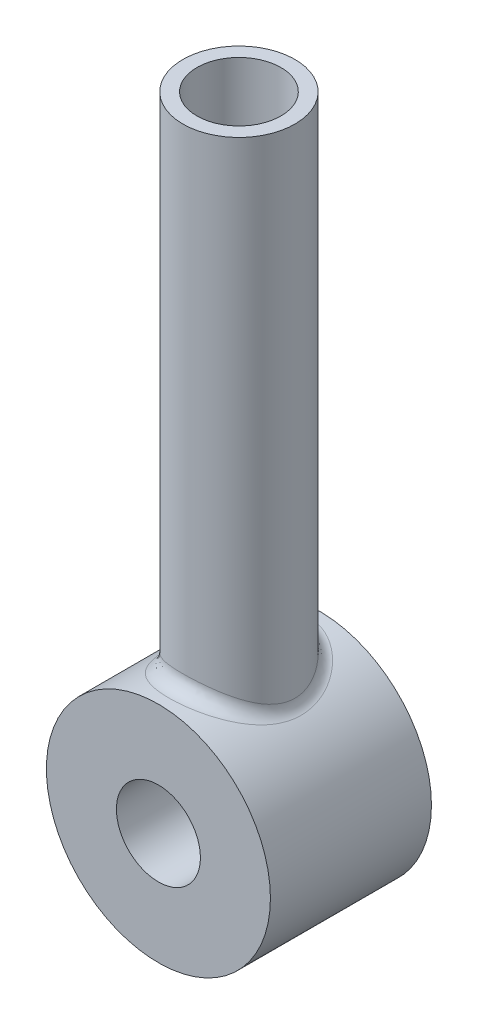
ISO-10303-21;
HEADER;
FILE_DESCRIPTION(('STEP AP214'),'2;1');
FILE_NAME('part.step','',(''),(''),'','','');
FILE_SCHEMA(('AUTOMOTIVE_DESIGN { 1 0 10303 214 1 1 1 1 }'));
ENDSEC;
DATA;
#1=APPLICATION_CONTEXT('core data for automotive mechanical design processes');
#2=APPLICATION_PROTOCOL_DEFINITION('international standard','automotive_design',2000,#1);
#3=PRODUCT_CONTEXT('',#1,'mechanical');
#4=PRODUCT('Part','Part','',(#3));
#5=PRODUCT_RELATED_PRODUCT_CATEGORY('part','',(#4));
#6=PRODUCT_DEFINITION_FORMATION('','',#4);
#7=PRODUCT_DEFINITION_CONTEXT('part definition',#1,'design');
#8=PRODUCT_DEFINITION('design','',#6,#7);
#9=PRODUCT_DEFINITION_SHAPE('','',#8);
#10=(LENGTH_UNIT() NAMED_UNIT(*) SI_UNIT(.MILLI.,.METRE.));
#11=(NAMED_UNIT(*) PLANE_ANGLE_UNIT() SI_UNIT($,.RADIAN.));
#12=(NAMED_UNIT(*) SI_UNIT($,.STERADIAN.) SOLID_ANGLE_UNIT());
#13=UNCERTAINTY_MEASURE_WITH_UNIT(LENGTH_MEASURE(1.E-05),#10,'distance_accuracy_value','');
#14=(GEOMETRIC_REPRESENTATION_CONTEXT(3) GLOBAL_UNCERTAINTY_ASSIGNED_CONTEXT((#13)) GLOBAL_UNIT_ASSIGNED_CONTEXT((#10,
#11,#12)) REPRESENTATION_CONTEXT('',''));
#15=CARTESIAN_POINT('',(0.,0.,0.));
#16=DIRECTION('',(0.,0.,1.));
#17=DIRECTION('',(1.,0.,0.));
#18=AXIS2_PLACEMENT_3D('',#15,#16,#17);
#19=CARTESIAN_POINT('',(1.12764573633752E-05,-7.38049995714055,15.8125404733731));
#20=DIRECTION('',(0.,0.,-1.));
#21=DIRECTION('',(-1.,0.,0.));
#22=AXIS2_PLACEMENT_3D('',#19,#20,#21);
#23=CYLINDRICAL_SURFACE('',#22,14.);
#24=CARTESIAN_POINT('',(-3.06461596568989,6.27995610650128,-2.29208771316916));
#25=CARTESIAN_POINT('',(-2.46024483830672,6.41554251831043,-0.811377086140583));
#26=CARTESIAN_POINT('',(-2.75815324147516,7.98751311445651,-0.683662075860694));
#27=CARTESIAN_POINT('',(-2.85996545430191,6.32586893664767,-2.39079084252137));
#28=CARTESIAN_POINT('',(-2.28454614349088,6.44540163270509,-0.876553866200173));
#29=CARTESIAN_POINT('',(-2.57396778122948,8.03916504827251,-0.762624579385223));
#30=CARTESIAN_POINT('',(-2.65081958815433,6.36794960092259,-2.47994843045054));
#31=CARTESIAN_POINT('',(-2.10892367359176,6.47177377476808,-0.933612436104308));
#32=CARTESIAN_POINT('',(-2.38573650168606,8.08650579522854,-0.833950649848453));
#33=CARTESIAN_POINT('',(-2.22511609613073,6.44322905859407,-2.63802722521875));
#34=CARTESIAN_POINT('',(-1.75666255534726,6.51800594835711,-1.03323233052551));
#35=CARTESIAN_POINT('',(-2.00260335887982,8.1711951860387,-0.960413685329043));
#36=CARTESIAN_POINT('',(-2.00856240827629,6.47643249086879,-2.70695900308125));
#37=CARTESIAN_POINT('',(-1.58035630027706,6.53776531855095,-1.0755727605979));
#38=CARTESIAN_POINT('',(-1.80770503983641,8.2085490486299,-1.01555910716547));
#39=CARTESIAN_POINT('',(-1.56986497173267,6.53296003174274,-2.82361732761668));
#40=CARTESIAN_POINT('',(-1.22745481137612,6.57088437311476,-1.14640009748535));
#41=CARTESIAN_POINT('',(-1.41287734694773,8.27214253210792,-1.10888576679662));
#42=CARTESIAN_POINT('',(-1.34772494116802,6.55629053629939,-2.87135760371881));
#43=CARTESIAN_POINT('',(-1.051269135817,6.58416455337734,-1.17471590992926));
#44=CARTESIAN_POINT('',(-1.21295131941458,8.29838934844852,-1.14707798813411));
#45=CARTESIAN_POINT('',(-0.899756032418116,6.59236250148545,-2.94494050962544));
#46=CARTESIAN_POINT('',(-0.698736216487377,6.60453078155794,-1.21810975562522));
#47=CARTESIAN_POINT('',(-0.809779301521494,8.33897030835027,-1.20594431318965));
#48=CARTESIAN_POINT('',(-0.673927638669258,6.60510534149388,-2.97078599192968));
#49=CARTESIAN_POINT('',(-0.522854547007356,6.61156228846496,-1.23307140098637));
#50=CARTESIAN_POINT('',(-0.606533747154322,8.35330600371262,-1.22662069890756));
#51=CARTESIAN_POINT('',(-0.248278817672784,6.61871636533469,-2.9983783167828));
#52=CARTESIAN_POINT('',(-0.192188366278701,6.61907760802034,-1.24906130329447));
#53=CARTESIAN_POINT('',(-0.223449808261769,8.36861840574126,-1.24869455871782));
#54=CARTESIAN_POINT('',(-0.0486246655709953,6.62083692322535,-3.0026669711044));
#55=CARTESIAN_POINT('',(-0.0377582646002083,6.62023590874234,-1.25152488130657));
#56=CARTESIAN_POINT('',(-0.0437610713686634,8.3710040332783,-1.25212548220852));
#57=CARTESIAN_POINT('',(0.350363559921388,6.61653753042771,-2.99395996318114));
#58=CARTESIAN_POINT('',(0.271547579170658,6.61787051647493,-1.24649309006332));
#59=CARTESIAN_POINT('',(0.31532833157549,8.36616721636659,-1.24515987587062));
#60=CARTESIAN_POINT('',(0.549697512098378,6.61011487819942,-2.98095883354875));
#61=CARTESIAN_POINT('',(0.426083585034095,6.61435052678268,-1.23900559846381));
#62=CARTESIAN_POINT('',(0.494728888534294,8.35894173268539,-1.23475897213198));
#63=CARTESIAN_POINT('',(0.946344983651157,6.58889100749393,-2.93784179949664));
#64=CARTESIAN_POINT('',(0.735611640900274,6.60253840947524,-1.21386245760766));
#65=CARTESIAN_POINT('',(0.8517116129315,8.3350648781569,-1.20026534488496));
#66=CARTESIAN_POINT('',(1.14365941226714,6.57409374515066,-2.90773397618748));
#67=CARTESIAN_POINT('',(0.89027401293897,6.59427394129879,-1.19626571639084));
#68=CARTESIAN_POINT('',(1.02929459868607,8.31841795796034,-1.17617908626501));
#69=CARTESIAN_POINT('',(1.53498585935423,6.53648649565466,-2.83077886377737));
#70=CARTESIAN_POINT('',(1.20014122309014,6.57281895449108,-1.15051141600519));
#71=CARTESIAN_POINT('',(1.38148840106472,8.27610980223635,-1.11461499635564));
#72=CARTESIAN_POINT('',(1.72899658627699,6.51367344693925,-2.78392517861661));
#73=CARTESIAN_POINT('',(1.35504116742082,6.55967072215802,-1.12244427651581));
#74=CARTESIAN_POINT('',(1.55609805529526,8.25044512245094,-1.07713204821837));
#75=CARTESIAN_POINT('',(2.10583117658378,6.46148196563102,-2.67589117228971));
#76=CARTESIAN_POINT('',(1.65981122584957,6.52881805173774,-1.05638838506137));
#77=CARTESIAN_POINT('',(1.89524918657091,8.19172970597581,-0.990704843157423));
#78=CARTESIAN_POINT('',(2.28881150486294,6.43235152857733,-2.61524866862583));
#79=CARTESIAN_POINT('',(1.80939528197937,6.51134103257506,-1.01889307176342));
#80=CARTESIAN_POINT('',(2.05993148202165,8.15895796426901,-0.942190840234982));
#81=CARTESIAN_POINT('',(2.64934938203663,6.3677586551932,-2.47947283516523));
#82=CARTESIAN_POINT('',(2.10816188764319,6.47157795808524,-0.93316492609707));
#83=CARTESIAN_POINT('',(2.38441557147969,8.08629098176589,-0.833570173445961));
#84=CARTESIAN_POINT('',(2.8269050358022,6.33229403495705,-2.40433450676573));
#85=CARTESIAN_POINT('',(2.25714481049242,6.4493541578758,-0.885069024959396));
#86=CARTESIAN_POINT('',(2.54421565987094,8.04639328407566,-0.773459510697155));
#87=CARTESIAN_POINT('',(3.34990097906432,6.2174881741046,-2.15820952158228));
#88=CARTESIAN_POINT('',(2.70041975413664,6.37579960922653,-0.724802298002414));
#89=CARTESIAN_POINT('',(3.01491200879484,7.91723669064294,-0.576559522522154));
#90=CARTESIAN_POINT('',(3.6859568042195,6.12969355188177,-1.96642961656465));
#91=CARTESIAN_POINT('',(2.99428236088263,6.3173315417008,-0.596135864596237));
#92=CARTESIAN_POINT('',(3.31736225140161,7.81846774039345,-0.42313559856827));
#93=CARTESIAN_POINT('',(4.35429850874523,5.93011064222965,-1.5146313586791));
#94=CARTESIAN_POINT('',(3.59416240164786,6.17725849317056,-0.279323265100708));
#95=CARTESIAN_POINT('',(3.91886978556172,7.59393696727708,-0.061696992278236));
#96=CARTESIAN_POINT('',(4.68375071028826,5.81690478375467,-1.2501492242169));
#97=CARTESIAN_POINT('',(3.89912891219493,6.09457258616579,-0.0882651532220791));
#98=CARTESIAN_POINT('',(4.21537676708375,7.46658037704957,0.149888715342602));
#99=CARTESIAN_POINT('',(5.300815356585,5.58139366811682,-0.669100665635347));
#100=CARTESIAN_POINT('',(4.48307001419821,5.91482470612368,0.347982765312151));
#101=CARTESIAN_POINT('',(4.77073494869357,7.20163037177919,0.614727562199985));
#102=CARTESIAN_POINT('',(5.5883869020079,5.45907969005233,-0.352483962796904));
#103=CARTESIAN_POINT('',(4.76253183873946,5.81809552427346,0.591949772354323));
#104=CARTESIAN_POINT('',(5.02954933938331,7.06402714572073,0.868020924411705));
#105=CARTESIAN_POINT('',(6.14745708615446,5.20179282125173,0.366101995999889));
#106=CARTESIAN_POINT('',(5.31325242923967,5.60861556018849,1.16052616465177));
#107=CARTESIAN_POINT('',(5.53271250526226,6.77457941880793,1.44288969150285));
#108=CARTESIAN_POINT('',(6.41333348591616,5.0669762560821,0.773695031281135));
#109=CARTESIAN_POINT('',(5.58222657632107,5.49494347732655,1.49111133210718));
#110=CARTESIAN_POINT('',(5.77200126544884,6.62291078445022,1.76896411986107));
#111=CARTESIAN_POINT('',(6.88087195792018,4.81476517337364,1.63961592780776));
#112=CARTESIAN_POINT('',(6.05900709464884,5.27812750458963,2.20770714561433));
#113=CARTESIAN_POINT('',(6.1927858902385,6.33917331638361,2.46170083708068));
#114=CARTESIAN_POINT('',(7.08258357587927,4.69735725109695,2.09790427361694));
#115=CARTESIAN_POINT('',(6.26902069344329,5.17433709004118,2.59399038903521));
#116=CARTESIAN_POINT('',(6.3743263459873,6.20708940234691,2.82833151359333));
#117=CARTESIAN_POINT('',(7.31624823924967,4.55595706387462,2.77315295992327));
#118=CARTESIAN_POINT('',(6.51371881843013,5.04784051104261,3.17160998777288));
#119=CARTESIAN_POINT('',(6.58462454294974,6.04801419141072,3.36853046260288));
#120=CARTESIAN_POINT('',(7.37829268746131,4.5176202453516,2.97362526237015));
#121=CARTESIAN_POINT('',(6.57872135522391,5.01344387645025,3.34323977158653));
#122=CARTESIAN_POINT('',(6.64046454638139,6.00488527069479,3.52890830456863));
#123=CARTESIAN_POINT('',(7.48954786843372,4.44790482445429,3.38048180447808));
#124=CARTESIAN_POINT('',(6.69544415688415,4.95070399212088,3.69269538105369));
#125=CARTESIAN_POINT('',(6.74059420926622,5.92645542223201,3.85439353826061));
#126=CARTESIAN_POINT('',(7.5387650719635,4.4165227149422,3.5868630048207));
#127=CARTESIAN_POINT('',(6.74730031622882,4.92229368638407,3.87067459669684));
#128=CARTESIAN_POINT('',(6.78488969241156,5.89115054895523,4.0194984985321));
#129=CARTESIAN_POINT('',(7.62378150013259,4.36176082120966,4.00423970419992));
#130=CARTESIAN_POINT('',(6.8369253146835,4.87262917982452,4.23143038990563));
#131=CARTESIAN_POINT('',(6.8614044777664,5.82954341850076,4.35339985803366));
#132=CARTESIAN_POINT('',(7.65959138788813,4.33837467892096,4.21523139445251));
#133=CARTESIAN_POINT('',(6.87481190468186,4.85131275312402,4.41439487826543));
#134=CARTESIAN_POINT('',(6.89363337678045,5.80323400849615,4.52219321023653));
#135=CARTESIAN_POINT('',(7.71738617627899,4.30039580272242,4.64060574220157));
#136=CARTESIAN_POINT('',(6.93594617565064,4.81667787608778,4.78372296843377));
#137=CARTESIAN_POINT('',(6.94564868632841,5.76050777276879,4.86249268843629));
#138=CARTESIAN_POINT('',(7.73937099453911,4.2858031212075,4.85498841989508));
#139=CARTESIAN_POINT('',(6.95927043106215,4.80331682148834,4.97030738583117));
#140=CARTESIAN_POINT('',(6.96543502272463,5.7440910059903,5.03399883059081));
#141=CARTESIAN_POINT('',(7.76924429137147,4.26593064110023,5.28628043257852));
#142=CARTESIAN_POINT('',(6.99093421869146,4.78513404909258,5.34578555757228));
#143=CARTESIAN_POINT('',(6.99232098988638,5.72173446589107,5.37903244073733));
#144=CARTESIAN_POINT('',(7.77708458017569,4.26068268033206,5.50319588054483));
#145=CARTESIAN_POINT('',(6.99926391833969,4.78031784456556,5.53492794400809));
#146=CARTESIAN_POINT('',(6.99937724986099,5.71583051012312,5.55256479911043));
#147=CARTESIAN_POINT('',(7.77840276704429,4.25980178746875,5.93710456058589));
#148=CARTESIAN_POINT('',(7.00066232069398,4.77951083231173,5.91304714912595));
#149=CARTESIAN_POINT('',(7.00056361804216,5.71483950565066,5.8996917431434));
#150=CARTESIAN_POINT('',(7.77188064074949,4.26416887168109,6.15409779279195));
#151=CARTESIAN_POINT('',(6.99373284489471,4.78351897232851,6.10227362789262));
#152=CARTESIAN_POINT('',(6.99469370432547,5.71975247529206,6.07328632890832));
#153=CARTESIAN_POINT('',(7.74456433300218,4.28235436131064,6.58651892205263));
#154=CARTESIAN_POINT('',(6.96477493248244,4.80016179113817,6.47879484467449));
#155=CARTESIAN_POINT('',(6.97010902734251,5.74021115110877,6.41922323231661));
#156=CARTESIAN_POINT('',(7.72376521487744,4.29617603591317,6.80194625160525));
#157=CARTESIAN_POINT('',(6.94270335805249,4.81282118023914,6.66633278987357));
#158=CARTESIAN_POINT('',(6.95138982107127,5.7557605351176,6.59156509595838));
#159=CARTESIAN_POINT('',(7.66821683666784,4.33272748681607,7.22948255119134));
#160=CARTESIAN_POINT('',(6.88393427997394,4.84616608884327,7.0376587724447));
#161=CARTESIAN_POINT('',(6.90139628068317,5.79688091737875,6.93359413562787));
#162=CARTESIAN_POINT('',(7.63346760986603,4.35545724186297,7.4415915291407));
#163=CARTESIAN_POINT('',(6.84716238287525,4.86689312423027,7.22167187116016));
#164=CARTESIAN_POINT('',(6.87012197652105,5.82245189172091,7.1032813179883));
#165=CARTESIAN_POINT('',(7.51279052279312,4.43335658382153,8.05129991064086));
#166=CARTESIAN_POINT('',(6.71966599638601,4.93770760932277,7.74978422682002));
#167=CARTESIAN_POINT('',(6.76151259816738,5.91008865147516,7.5910480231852));
#168=CARTESIAN_POINT('',(7.40901524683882,4.49926147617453,8.44289742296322));
#169=CARTESIAN_POINT('',(6.61007442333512,4.99746357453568,8.08724166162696));
#170=CARTESIAN_POINT('',(6.66811484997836,5.98423165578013,7.90432603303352));
#171=CARTESIAN_POINT('',(7.15639663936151,4.65311213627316,9.20103733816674));
#172=CARTESIAN_POINT('',(6.34639579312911,5.13476746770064,8.73406999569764));
#173=CARTESIAN_POINT('',(6.44075810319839,6.15731364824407,8.5108379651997));
#174=CARTESIAN_POINT('',(7.0075377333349,4.74106551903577,9.56757102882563));
#175=CARTESIAN_POINT('',(6.19129269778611,5.21278070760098,9.04430615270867));
#176=CARTESIAN_POINT('',(6.30678508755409,6.25626120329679,8.80406491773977));
#177=CARTESIAN_POINT('',(6.64722240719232,4.94274437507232,10.315493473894));
#178=CARTESIAN_POINT('',(5.82079564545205,5.38836628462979,9.66970952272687));
#179=CARTESIAN_POINT('',(5.98250129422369,6.48314991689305,9.40240287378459));
#180=CARTESIAN_POINT('',(6.43022143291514,5.05832369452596,10.6928708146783));
#181=CARTESIAN_POINT('',(5.59918201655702,5.48748501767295,9.98032156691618));
#182=CARTESIAN_POINT('',(5.78720041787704,6.61317665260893,9.70430474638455));
#183=CARTESIAN_POINT('',(5.94879110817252,5.29562427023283,11.4046812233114));
#184=CARTESIAN_POINT('',(5.11729194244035,5.68551741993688,10.5551730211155));
#185=CARTESIAN_POINT('',(5.3539131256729,6.88013980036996,10.273753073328));
#186=CARTESIAN_POINT('',(5.68432019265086,5.41735084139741,11.7390762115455));
#187=CARTESIAN_POINT('',(4.85563567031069,5.78465065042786,10.8190613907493));
#188=CARTESIAN_POINT('',(5.115889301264,7.01708219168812,10.5412690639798));
#189=CARTESIAN_POINT('',(5.07333801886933,5.67266442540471,12.4016917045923));
#190=CARTESIAN_POINT('',(4.26484505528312,5.98612177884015,11.3304274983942));
#191=CARTESIAN_POINT('',(4.56600534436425,7.30430997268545,11.0713614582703));
#192=CARTESIAN_POINT('',(4.72057041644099,5.80563238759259,12.7229763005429));
#193=CARTESIAN_POINT('',(3.93121897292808,6.0865087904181,11.5686378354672));
#194=CARTESIAN_POINT('',(4.24851450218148,7.45389893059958,11.3283891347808));
#195=CARTESIAN_POINT('',(3.96605984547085,6.05183585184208,13.2943199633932));
#196=CARTESIAN_POINT('',(3.24101181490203,6.26455979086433,11.9792087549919));
#197=CARTESIAN_POINT('',(3.56945498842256,7.73087782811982,11.7854640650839));
#198=CARTESIAN_POINT('',(3.56435311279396,6.16508580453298,13.5444312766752));
#199=CARTESIAN_POINT('',(2.88465344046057,6.34143492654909,12.1494068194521));
#200=CARTESIAN_POINT('',(3.20791892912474,7.85828402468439,11.985553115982));
#201=CARTESIAN_POINT('',(2.78557937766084,6.34446782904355,13.9314022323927));
#202=CARTESIAN_POINT('',(2.21790674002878,6.45813736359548,12.4046320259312));
#203=CARTESIAN_POINT('',(2.50702256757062,8.06008880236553,12.2951298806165));
#204=CARTESIAN_POINT('',(2.41410548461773,6.41515269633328,14.0797193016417));
#205=CARTESIAN_POINT('',(1.90918696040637,6.50131881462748,12.4975161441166));
#206=CARTESIAN_POINT('',(2.1726960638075,8.13960927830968,12.4137835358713));
#207=CARTESIAN_POINT('',(1.84240797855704,6.49908675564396,14.2539201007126));
#208=CARTESIAN_POINT('',(1.44618355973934,6.55114706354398,12.6042969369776));
#209=CARTESIAN_POINT('',(1.65816830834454,8.23403509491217,12.5531441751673));
#210=CARTESIAN_POINT('',(1.64938907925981,6.52338512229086,14.303946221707));
#211=CARTESIAN_POINT('',(1.29142896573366,6.5652557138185,12.6344426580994));
#212=CARTESIAN_POINT('',(1.48445129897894,8.26137075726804,12.5931650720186));
#213=CARTESIAN_POINT('',(1.25974188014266,6.56408149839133,14.3873862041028));
#214=CARTESIAN_POINT('',(0.981768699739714,6.58861888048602,12.6842991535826));
#215=CARTESIAN_POINT('',(1.13376881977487,8.30715418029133,12.6599170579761));
#216=CARTESIAN_POINT('',(1.06311501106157,6.58048257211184,14.4208065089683));
#217=CARTESIAN_POINT('',(0.827160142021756,6.5978279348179,12.7039125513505));
#218=CARTESIAN_POINT('',(0.956804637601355,8.32560538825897,12.6866533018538));
#219=CARTESIAN_POINT('',(0.670166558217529,6.60481993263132,14.4703018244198));
#220=CARTESIAN_POINT('',(0.519817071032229,6.61142505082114,12.7328612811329));
#221=CARTESIAN_POINT('',(0.603151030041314,8.3529849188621,12.726249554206));
#222=CARTESIAN_POINT('',(0.473872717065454,6.61286091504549,14.4865913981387));
#223=CARTESIAN_POINT('',(0.367392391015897,6.61584470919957,12.7422640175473));
#224=CARTESIAN_POINT('',(0.426486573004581,8.36203102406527,12.7392812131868));
#225=CARTESIAN_POINT('',(0.0806598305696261,6.62064789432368,14.5023672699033));
#226=CARTESIAN_POINT('',(0.0623597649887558,6.62013485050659,12.7513911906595));
#227=CARTESIAN_POINT('',(0.0725949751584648,8.37079137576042,12.751901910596));
#228=CARTESIAN_POINT('',(-0.116258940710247,6.62039712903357,14.5018601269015));
#229=CARTESIAN_POINT('',(-0.0899234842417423,6.61999799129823,12.7511000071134));
#230=CARTESIAN_POINT('',(-0.104631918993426,8.37050926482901,12.7514961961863));
#231=CARTESIAN_POINT('',(-0.509401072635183,6.61161139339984,14.4840589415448));
#232=CARTESIAN_POINT('',(-0.39498250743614,6.61515546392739,12.7407976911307));
#233=CARTESIAN_POINT('',(-0.458459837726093,8.36062531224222,12.737255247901));
#234=CARTESIAN_POINT('',(-0.705624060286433,6.60307250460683,14.4667569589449));
#235=CARTESIAN_POINT('',(-0.547433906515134,6.61045793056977,12.7308038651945));
#236=CARTESIAN_POINT('',(-0.635060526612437,8.35101906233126,12.7234136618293));
#237=CARTESIAN_POINT('',(-1.09575891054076,6.57791996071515,14.4155841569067));
#238=CARTESIAN_POINT('',(-0.852806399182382,6.59638699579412,12.700842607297));
#239=CARTESIAN_POINT('',(-0.986181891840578,8.32272245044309,12.6824754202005));
#240=CARTESIAN_POINT('',(-1.28967153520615,6.56130904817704,14.381718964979));
#241=CARTESIAN_POINT('',(-1.00541598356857,6.5870443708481,12.6809407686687));
#242=CARTESIAN_POINT('',(-1.16070325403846,8.3040351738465,12.655383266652));
#243=CARTESIAN_POINT('',(-1.67347425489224,6.52045730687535,14.2979239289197));
#244=CARTESIAN_POINT('',(-1.31072933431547,6.56355600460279,12.6308139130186));
#245=CARTESIAN_POINT('',(-1.50612570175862,8.25807696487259,12.5883472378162));
#246=CARTESIAN_POINT('',(-1.86337205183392,6.49623283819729,14.2480285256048));
#247=CARTESIAN_POINT('',(-1.46314683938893,6.54946681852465,12.6007101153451));
#248=CARTESIAN_POINT('',(-1.67703371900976,8.23082443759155,12.5484309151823));
#249=CARTESIAN_POINT('',(-2.23830550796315,6.44071042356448,14.1327276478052));
#250=CARTESIAN_POINT('',(-1.7680014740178,6.51634945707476,12.5297104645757));
#251=CARTESIAN_POINT('',(-2.01447382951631,8.16836172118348,12.4561902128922));
#252=CARTESIAN_POINT('',(-2.42334191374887,6.4094135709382,14.0673245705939));
#253=CARTESIAN_POINT('',(-1.92019248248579,6.49738209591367,12.488946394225));
#254=CARTESIAN_POINT('',(-2.18100659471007,8.13315276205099,12.4038677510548));
#255=CARTESIAN_POINT('',(-2.78750065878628,6.34043682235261,13.9216719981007));
#256=CARTESIAN_POINT('',(-2.22398572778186,6.45444664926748,12.3961712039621));
#257=CARTESIAN_POINT('',(-2.50874946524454,8.05555391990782,12.2873456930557));
#258=CARTESIAN_POINT('',(-2.96662329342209,6.30275724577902,13.8414232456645));
#259=CARTESIAN_POINT('',(-2.37538857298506,6.43054833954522,12.3443144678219));
#260=CARTESIAN_POINT('',(-2.66995983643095,8.01316439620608,12.2231466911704));
#261=CARTESIAN_POINT('',(-3.31811545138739,6.2218026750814,13.6667825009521));
#262=CARTESIAN_POINT('',(-2.67676818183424,6.3778380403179,12.2290008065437));
#263=CARTESIAN_POINT('',(-2.9863027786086,7.92209050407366,12.0834340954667));
#264=CARTESIAN_POINT('',(-3.49048048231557,6.17852403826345,13.5723812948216));
#265=CARTESIAN_POINT('',(-2.82659941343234,6.34909575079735,12.1657036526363));
#266=CARTESIAN_POINT('',(-3.14143130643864,7.87340203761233,12.0079131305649));
#267=CARTESIAN_POINT('',(-4.01120056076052,6.03750809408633,13.2600439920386));
#268=CARTESIAN_POINT('',(-3.28325549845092,6.25351789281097,11.952969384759));
#269=CARTESIAN_POINT('',(-3.61007937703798,7.71475910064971,11.7580432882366));
#270=CARTESIAN_POINT('',(-4.34691952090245,5.93176597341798,13.0194805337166));
#271=CARTESIAN_POINT('',(-3.58808224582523,6.17865837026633,11.7834905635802));
#272=CARTESIAN_POINT('',(-3.9122264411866,7.59579921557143,11.5655925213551));
#273=CARTESIAN_POINT('',(-4.97955265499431,5.70830409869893,12.4863672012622));
#274=CARTESIAN_POINT('',(-4.17666462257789,6.01263680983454,11.3919136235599));
#275=CARTESIAN_POINT('',(-4.48159626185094,7.34440460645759,11.1391018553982));
#276=CARTESIAN_POINT('',(-5.27644147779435,5.59057660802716,12.1937836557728));
#277=CARTESIAN_POINT('',(-4.46058488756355,5.92190562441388,11.1711356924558));
#278=CARTESIAN_POINT('',(-4.74879620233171,7.21196117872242,10.9050350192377));
#279=CARTESIAN_POINT('',(-5.70607155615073,5.4049982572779,11.7011752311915));
#280=CARTESIAN_POINT('',(-4.88044146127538,5.77327191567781,10.7860989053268));
#281=CARTESIAN_POINT('',(-5.13546327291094,7.00318553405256,10.5109482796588));
#282=CARTESIAN_POINT('',(-5.85365825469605,5.33793935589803,11.516901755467));
#283=CARTESIAN_POINT('',(-5.02572954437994,5.71886469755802,10.6408199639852));
#284=CARTESIAN_POINT('',(-5.26829130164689,6.92774427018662,10.3635294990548));
#285=CARTESIAN_POINT('',(-6.13444036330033,5.20491321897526,11.1348894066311));
#286=CARTESIAN_POINT('',(-5.30439660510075,5.60934913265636,10.3357421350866));
#287=CARTESIAN_POINT('',(-5.52099519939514,6.77808986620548,10.0579196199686));
#288=CARTESIAN_POINT('',(-6.26764897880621,5.13894502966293,10.9371631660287));
#289=CARTESIAN_POINT('',(-5.4379979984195,5.55422007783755,10.1760413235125));
#290=CARTESIAN_POINT('',(-5.64088295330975,6.70387565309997,9.89973862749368));
#291=CARTESIAN_POINT('',(-6.64511637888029,4.94517092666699,10.3241138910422));
#292=CARTESIAN_POINT('',(-5.81701830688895,5.39114616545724,9.67803454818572));
#293=CARTESIAN_POINT('',(-5.98060361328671,6.48587978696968,9.40929920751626));
#294=CARTESIAN_POINT('',(-6.86714824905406,4.82152637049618,9.88899869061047));
#295=CARTESIAN_POINT('',(-6.04607972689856,5.28346740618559,9.31563030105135));
#296=CARTESIAN_POINT('',(-6.18043229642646,6.34677966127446,9.06120704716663));
#297=CARTESIAN_POINT('',(-7.15128973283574,4.65574978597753,9.20010915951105));
#298=CARTESIAN_POINT('',(-6.34152534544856,5.1368354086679,8.73175276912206));
#299=CARTESIAN_POINT('',(-6.4361596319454,6.16028100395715,8.51009542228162));
#300=CARTESIAN_POINT('',(-7.23843373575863,4.60337582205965,8.96202398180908));
#301=CARTESIAN_POINT('',(-6.43241209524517,5.09020782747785,8.52929295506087));
#302=CARTESIAN_POINT('',(-6.51458923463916,6.101360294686,8.31962728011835));
#303=CARTESIAN_POINT('',(-7.39422377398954,4.50788168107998,8.47609459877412));
#304=CARTESIAN_POINT('',(-6.59521943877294,5.00481192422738,8.11408082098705));
#305=CARTESIAN_POINT('',(-6.65480026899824,5.99392938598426,7.93088377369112));
#306=CARTESIAN_POINT('',(-7.46288231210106,4.46475525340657,8.22825712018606));
#307=CARTESIAN_POINT('',(-6.66740626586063,4.96591991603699,7.90109769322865));
#308=CARTESIAN_POINT('',(-6.71659295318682,5.94541215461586,7.73261379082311));
#309=CARTESIAN_POINT('',(-7.58057073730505,4.38978720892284,7.72505508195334));
#310=CARTESIAN_POINT('',(-6.7912354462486,4.8981428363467,7.46726175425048));
#311=CARTESIAN_POINT('',(-6.82251253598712,5.8610731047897,7.33005216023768));
#312=CARTESIAN_POINT('',(-7.62963074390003,4.35792828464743,7.46970272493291));
#313=CARTESIAN_POINT('',(-6.84312152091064,4.8691328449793,7.24610198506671));
#314=CARTESIAN_POINT('',(-6.86666654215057,5.82523181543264,7.12577027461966));
#315=CARTESIAN_POINT('',(-7.70735884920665,4.30704154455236,6.95350992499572));
#316=CARTESIAN_POINT('',(-6.92528839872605,4.82277487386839,6.7982925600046));
#317=CARTESIAN_POINT('',(-6.93662183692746,5.76798423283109,6.7128160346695));
#318=CARTESIAN_POINT('',(-7.73603150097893,4.2880108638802,6.6926707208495));
#319=CARTESIAN_POINT('',(-6.9557254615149,4.80534071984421,6.57125531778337));
#320=CARTESIAN_POINT('',(-6.96242722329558,5.74657471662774,6.50414467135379));
#321=CARTESIAN_POINT('',(-7.76963307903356,4.26565596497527,6.20812389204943));
#322=CARTESIAN_POINT('',(-6.99134816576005,4.78488240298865,6.14936263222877));
#323=CARTESIAN_POINT('',(-6.99266864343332,5.72142545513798,6.11650720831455));
#324=CARTESIAN_POINT('',(-7.77750218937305,4.2603882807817,5.9847807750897));
#325=CARTESIAN_POINT('',(-6.99970859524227,4.78004794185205,5.95460206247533));
#326=CARTESIAN_POINT('',(-6.99975084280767,5.71549931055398,5.93783271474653));
#327=CARTESIAN_POINT('',(-7.77801763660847,4.26004434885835,5.53807802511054));
#328=CARTESIAN_POINT('',(-7.00025486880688,4.7797332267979,5.56533275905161));
#329=CARTESIAN_POINT('',(-7.00021474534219,5.71511238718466,5.58047051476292));
#330=CARTESIAN_POINT('',(-7.7706656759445,4.26496696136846,5.31471839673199));
#331=CARTESIAN_POINT('',(-6.99244328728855,4.78425148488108,5.3705516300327));
#332=CARTESIAN_POINT('',(-6.99359798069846,5.72065032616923,5.40178281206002));
#333=CARTESIAN_POINT('',(-7.74085129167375,4.28480620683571,4.86980968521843));
#334=CARTESIAN_POINT('',(-6.96083985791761,4.80240534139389,4.98319609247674));
#335=CARTESIAN_POINT('',(-6.9667650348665,5.7429694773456,5.04585584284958));
#336=CARTESIAN_POINT('',(-7.71838643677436,4.29972444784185,4.64826089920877));
#337=CARTESIAN_POINT('',(-6.93700164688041,4.81606747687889,4.79035681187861));
#338=CARTESIAN_POINT('',(-6.94654666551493,5.75975249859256,4.86861681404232));
#339=CARTESIAN_POINT('',(-7.65871437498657,4.33893540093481,4.20881560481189));
#340=CARTESIAN_POINT('',(-6.87388407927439,4.85182527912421,4.40880456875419));
#341=CARTESIAN_POINT('',(-6.89284180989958,5.80386482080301,4.51706057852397));
#342=CARTESIAN_POINT('',(-7.62150700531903,4.36322821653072,3.99091913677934));
#343=CARTESIAN_POINT('',(-6.83452017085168,4.87396798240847,4.21984854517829));
#344=CARTESIAN_POINT('',(-6.85935517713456,5.83119423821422,4.34274340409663));
#345=CARTESIAN_POINT('',(-7.49492190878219,4.44471495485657,3.37624020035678));
#346=CARTESIAN_POINT('',(-6.7008453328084,4.94798638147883,3.68775877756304));
#347=CARTESIAN_POINT('',(-6.74542859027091,5.92286681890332,3.85100025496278));
#348=CARTESIAN_POINT('',(-7.38812340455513,4.51229171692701,2.98554970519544));
#349=CARTESIAN_POINT('',(-6.58813549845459,5.00919189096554,3.35138013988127));
#350=CARTESIAN_POINT('',(-6.64930993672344,5.99889067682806,3.53844785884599));
#351=CARTESIAN_POINT('',(-7.12963059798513,4.66901744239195,2.22966935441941));
#352=CARTESIAN_POINT('',(-6.31854330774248,5.1488786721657,2.70717141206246));
#353=CARTESIAN_POINT('',(-6.41666641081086,6.17520711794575,2.93374357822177));
#354=CARTESIAN_POINT('',(-6.97792300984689,4.75817278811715,1.8644870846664));
#355=CARTESIAN_POINT('',(-6.16063392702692,5.2278243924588,2.39850483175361));
#356=CARTESIAN_POINT('',(-6.28012958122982,6.27550688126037,2.64159776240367));
#357=CARTESIAN_POINT('',(-6.61094545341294,4.96230352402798,1.11825951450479));
#358=CARTESIAN_POINT('',(-5.78373573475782,5.40520277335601,1.77549195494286));
#359=CARTESIAN_POINT('',(-5.94984978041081,6.50515395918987,2.04461570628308));
#360=CARTESIAN_POINT('',(-6.38994904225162,5.07913167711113,0.741413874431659));
#361=CARTESIAN_POINT('',(-5.55839510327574,5.50513571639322,1.46597052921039));
#362=CARTESIAN_POINT('',(-5.75095301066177,6.63658563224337,1.74313919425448));
#363=CARTESIAN_POINT('',(-5.90040432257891,5.3182996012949,0.0314532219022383));
#364=CARTESIAN_POINT('',(-5.06928836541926,5.70413199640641,0.894015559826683));
#365=CARTESIAN_POINT('',(-5.31036276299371,6.90564954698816,1.17517067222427));
#366=CARTESIAN_POINT('',(-5.63181755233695,5.44064377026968,-0.301626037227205));
#367=CARTESIAN_POINT('',(-4.80414894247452,5.80339426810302,0.631982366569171));
#368=CARTESIAN_POINT('',(-5.06863466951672,7.04328673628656,0.908707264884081));
#369=CARTESIAN_POINT('',(-5.01272129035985,5.69613402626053,-0.95954552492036));
#370=CARTESIAN_POINT('',(-4.20725087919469,6.00409657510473,0.126093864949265));
#371=CARTESIAN_POINT('',(-4.51144803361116,7.33071327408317,0.382371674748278));
#372=CARTESIAN_POINT('',(-4.65608510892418,5.82858812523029,-1.27755683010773));
#373=CARTESIAN_POINT('',(-3.87120045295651,6.10350922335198,-0.10858959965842));
#374=CARTESIAN_POINT('',(-4.1904754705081,7.47972413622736,0.127962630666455));
#375=CARTESIAN_POINT('',(-4.08499696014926,6.01177344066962,-1.70037062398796));
#376=CARTESIAN_POINT('',(-3.35381985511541,6.2344380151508,-0.409129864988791));
#377=CARTESIAN_POINT('',(-3.67649613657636,7.68580761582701,-0.210288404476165));
#378=CARTESIAN_POINT('',(-3.88849773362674,6.07027957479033,-1.83233046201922));
#379=CARTESIAN_POINT('',(-3.17745452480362,6.27532685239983,-0.501298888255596));
#380=CARTESIAN_POINT('',(-3.49964683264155,7.75162701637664,-0.315856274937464));
#381=CARTESIAN_POINT('',(-3.48448026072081,6.18054871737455,-2.07697488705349));
#382=CARTESIAN_POINT('',(-2.82076737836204,6.35061311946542,-0.669114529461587));
#383=CARTESIAN_POINT('',(-3.13603110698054,7.87567980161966,-0.511571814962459));
#384=CARTESIAN_POINT('',(-3.27696814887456,6.23231542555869,-2.18967006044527));
#385=CARTESIAN_POINT('',(-2.64059668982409,6.38489262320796,-0.744474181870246));
#386=CARTESIAN_POINT('',(-2.94927020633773,7.9339173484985,-0.601727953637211));
#387=CARTESIAN_POINT('',(-3.06461596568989,6.27995610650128,-2.29208771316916));
#388=CARTESIAN_POINT('',(-2.46024483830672,6.41554251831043,-0.811377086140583));
#389=CARTESIAN_POINT('',(-2.75815324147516,7.98751311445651,-0.683662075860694));
#390=(BOUNDED_SURFACE() B_SPLINE_SURFACE(3,2,((#24,#25,#26),(#27,#28,#29),(#30,#31,#32),(#33,
#34,#35),(#36,#37,#38),(#39,#40,#41),(#42,#43,#44),(#45,#46,#47),(#48,#49,#50),(#51,#52,#53),
(#54,#55,#56),(#57,#58,#59),(#60,#61,#62),(#63,#64,#65),(#66,#67,#68),(#69,#70,#71),(#72,#73,
#74),(#75,#76,#77),(#78,#79,#80),(#81,#82,#83),(#84,#85,#86),(#87,#88,#89),(#90,#91,#92),(#93,
#94,#95),(#96,#97,#98),(#99,#100,#101),(#102,#103,#104),(#105,#106,#107),(#108,#109,#110),(#111,
#112,#113),(#114,#115,#116),(#117,#118,#119),(#120,#121,#122),(#123,#124,#125),(#126,#127,#128),
(#129,#130,#131),(#132,#133,#134),(#135,#136,#137),(#138,#139,#140),(#141,#142,#143),(#144,#145,
#146),(#147,#148,#149),(#150,#151,#152),(#153,#154,#155),(#156,#157,#158),(#159,#160,#161),
(#162,#163,#164),(#165,#166,#167),(#168,#169,#170),(#171,#172,#173),(#174,#175,#176),(#177,#178,
#179),(#180,#181,#182),(#183,#184,#185),(#186,#187,#188),(#189,#190,#191),(#192,#193,#194),
(#195,#196,#197),(#198,#199,#200),(#201,#202,#203),(#204,#205,#206),(#207,#208,#209),(#210,#211,
#212),(#213,#214,#215),(#216,#217,#218),(#219,#220,#221),(#222,#223,#224),(#225,#226,#227),
(#228,#229,#230),(#231,#232,#233),(#234,#235,#236),(#237,#238,#239),(#240,#241,#242),(#243,#244,
#245),(#246,#247,#248),(#249,#250,#251),(#252,#253,#254),(#255,#256,#257),(#258,#259,#260),
(#261,#262,#263),(#264,#265,#266),(#267,#268,#269),(#270,#271,#272),(#273,#274,#275),(#276,#277,
#278),(#279,#280,#281),(#282,#283,#284),(#285,#286,#287),(#288,#289,#290),(#291,#292,#293),
(#294,#295,#296),(#297,#298,#299),(#300,#301,#302),(#303,#304,#305),(#306,#307,#308),(#309,#310,
#311),(#312,#313,#314),(#315,#316,#317),(#318,#319,#320),(#321,#322,#323),(#324,#325,#326),
(#327,#328,#329),(#330,#331,#332),(#333,#334,#335),(#336,#337,#338),(#339,#340,#341),(#342,#343,
#344),(#345,#346,#347),(#348,#349,#350),(#351,#352,#353),(#354,#355,#356),(#357,#358,#359),
(#360,#361,#362),(#363,#364,#365),(#366,#367,#368),(#369,#370,#371),(#372,#373,#374),(#375,#376,
#377),(#378,#379,#380),(#381,#382,#383),(#384,#385,#386),(#387,#388,#389)),.UNSPECIFIED.,.T.,
.F.,.F.) B_SPLINE_SURFACE_WITH_KNOTS((4,2,2,2,2,2,2,2,2,2,2,2,2,2,2,2,2,2,2,2,2,2,2,2,2,2,2,2,2,
2,2,2,2,2,2,2,2,2,2,2,2,2,2,2,2,2,2,2,2,2,2,2,2,2,2,2,2,2,2,2,4),(3,3),(0.,0.767013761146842,
1.5336259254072,2.2997406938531,3.06575563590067,3.73889896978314,4.41225521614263,
5.08529363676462,5.75858939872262,6.40912585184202,7.05988703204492,8.36041194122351,
9.7732877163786,11.1875341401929,12.7639146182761,14.3390749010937,14.9883667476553,
15.6373304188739,16.2857768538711,16.9342271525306,17.5848825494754,18.2355390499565,
18.886420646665,19.537300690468,20.7777128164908,22.0185539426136,23.4167626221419,
24.8162016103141,26.4046809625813,27.9919912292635,29.3370992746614,30.0099128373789,
30.6824651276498,31.3464895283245,32.0102546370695,32.6743337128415,33.3381873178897,
34.000624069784,34.6629584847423,35.3252597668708,35.9879941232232,37.3720402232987,
38.756985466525,39.5339594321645,40.3102136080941,41.863063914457,42.6545424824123,
43.4454843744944,44.2352060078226,45.0247512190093,45.6946220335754,46.3644179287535,
47.0343216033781,47.7042326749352,48.9460579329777,50.1882509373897,51.5933395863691,
52.9995690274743,54.5905091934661,55.3868272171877,56.182706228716),(0.,1.),
.UNSPECIFIED.) GEOMETRIC_REPRESENTATION_ITEM() RATIONAL_B_SPLINE_SURFACE(((1.,0.736971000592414,
1.),(1.,0.733063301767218,1.),(1.,0.729430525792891,1.),(1.,0.722867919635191,1.),(1.,
0.719937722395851,1.),(1.,0.714914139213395,1.),(1.,0.712820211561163,1.),(1.,0.709570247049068,
1.),(1.,0.708414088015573,1.),(1.,0.707178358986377,1.),(1.,0.706985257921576,1.),(1.,
0.70737608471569,1.),(1.,0.707960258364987,1.),(1.,0.709882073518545,1.),(1.,0.711219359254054,
1.),(1.,0.714594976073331,1.),(1.,0.716633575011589,1.),(1.,0.721255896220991,1.),(1.,
0.723818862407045,1.),(1.,0.729443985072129,1.),(1.,0.73250631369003,1.),(1.,0.742303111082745,
1.),(1.,0.74965114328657,1.),(1.,0.765880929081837,1.),(1.,0.774840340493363,1.),(1.,
0.792885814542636,1.),(1.,0.801971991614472,1.),(1.,0.820503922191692,1.),(1.,0.829871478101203,
1.),(1.,0.846893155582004,1.),(1.,0.854548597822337,1.),(1.,0.863582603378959,1.),(1.,
0.866005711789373,1.),(1.,0.870379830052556,1.),(1.,0.872331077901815,1.),(1.,0.875717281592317,
1.),(1.,0.877152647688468,1.),(1.,0.879475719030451,1.),(1.,0.880363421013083,1.),(1.,
0.881570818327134,1.),(1.,0.881888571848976,1.),(1.,0.881941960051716,1.),(1.,0.881677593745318,
1.),(1.,0.8805731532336,1.),(1.,0.879732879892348,1.),(1.,0.877498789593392,1.),(1.,
0.876104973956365,1.),(1.,0.871293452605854,1.),(1.,0.867186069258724,1.),(1.,0.857389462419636,
1.),(1.,0.851699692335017,1.),(1.,0.838316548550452,1.),(1.,0.830460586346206,1.),(1.,
0.813817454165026,1.),(1.,0.805029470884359,1.),(1.,0.786005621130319,1.),(1.,0.775734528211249,
1.),(1.,0.756090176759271,1.),(1.,0.746716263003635,1.),(1.,0.731502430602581,1.),(1.,
0.725341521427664,1.),(1.,0.717930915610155,1.),(1.,0.715765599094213,1.),(1.,0.712121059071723,
1.),(1.,0.710641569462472,1.),(1.,0.708440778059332,1.),(1.,0.707710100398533,1.),(1.,
0.707002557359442,1.),(1.,0.707025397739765,1.),(1.,0.707823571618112,1.),(1.,0.708599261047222,
1.),(1.,0.710872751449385,1.),(1.,0.712370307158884,1.),(1.,0.71602669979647,1.),(1.,
0.718184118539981,1.),(1.,0.723083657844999,1.),(1.,0.72582568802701,1.),(1.,0.731803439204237,
1.),(1.,0.735039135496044,1.),(1.,0.741906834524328,1.),(1.,0.745539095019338,1.),(1.,
0.757215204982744,1.),(1.,0.765757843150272,1.),(1.,0.783246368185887,1.),(1.,0.792192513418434,
1.),(1.,0.805867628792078,1.),(1.,0.810723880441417,1.),(1.,0.820201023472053,1.),(1.,
0.824822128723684,1.),(1.,0.838183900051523,1.),(1.,0.84642076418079,1.),(1.,0.857206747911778,
1.),(1.,0.860564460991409,1.),(1.,0.866624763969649,1.),(1.,0.869327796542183,1.),(1.,
0.8739911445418,1.),(1.,0.875952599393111,1.),(1.,0.879071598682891,1.),(1.,0.880229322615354,
1.),(1.,0.881587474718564,1.),(1.,0.881906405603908,1.),(1.,0.881927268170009,1.),(1.,
0.881629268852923,1.),(1.,0.880424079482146,1.),(1.,0.879516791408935,1.),(1.,0.877118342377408,
1.),(1.,0.875627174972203,1.),(1.,0.87058655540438,1.),(1.,0.866366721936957,1.),(1.,
0.85636433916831,1.),(1.,0.850581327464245,1.),(1.,0.836996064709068,1.),(1.,0.829028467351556,
1.),(1.,0.812194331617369,1.),(1.,0.803327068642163,1.),(1.,0.784212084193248,1.),(1.,
0.773936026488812,1.),(1.,0.759264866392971,1.),(1.,0.754495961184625,1.),(1.,0.745376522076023,
1.),(1.,0.741025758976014,1.),(1.,0.736971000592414,1.))) REPRESENTATION_ITEM('') SURFACE());
#391=CARTESIAN_POINT('',(-3.06461596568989,6.27995610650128,-2.29208771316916));
#392=CARTESIAN_POINT('',(-2.85996545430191,6.32586893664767,-2.39079084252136));
#393=CARTESIAN_POINT('',(-2.65081958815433,6.36794960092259,-2.47994843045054));
#394=CARTESIAN_POINT('',(-2.22511609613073,6.44322905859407,-2.63802722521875));
#395=CARTESIAN_POINT('',(-2.00856240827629,6.47643249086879,-2.70695900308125));
#396=CARTESIAN_POINT('',(-1.56986497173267,6.53296003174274,-2.82361732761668));
#397=CARTESIAN_POINT('',(-1.34772494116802,6.55629053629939,-2.87135760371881));
#398=CARTESIAN_POINT('',(-0.899756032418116,6.59236250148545,-2.94494050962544));
#399=CARTESIAN_POINT('',(-0.673927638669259,6.60510534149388,-2.97078599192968));
#400=CARTESIAN_POINT('',(-0.248278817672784,6.61871636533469,-2.9983783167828));
#401=CARTESIAN_POINT('',(-0.0486246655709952,6.62083692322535,-3.0026669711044));
#402=CARTESIAN_POINT('',(0.350363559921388,6.61653753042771,-2.99395996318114));
#403=CARTESIAN_POINT('',(0.549697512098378,6.61011487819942,-2.98095883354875));
#404=CARTESIAN_POINT('',(0.946344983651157,6.58889100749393,-2.93784179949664));
#405=CARTESIAN_POINT('',(1.14365941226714,6.57409374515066,-2.90773397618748));
#406=CARTESIAN_POINT('',(1.53498585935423,6.53648649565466,-2.83077886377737));
#407=CARTESIAN_POINT('',(1.72899658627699,6.51367344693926,-2.78392517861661));
#408=CARTESIAN_POINT('',(2.10583117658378,6.46148196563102,-2.67589117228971));
#409=CARTESIAN_POINT('',(2.28881150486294,6.43235152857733,-2.61524866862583));
#410=CARTESIAN_POINT('',(2.64934938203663,6.3677586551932,-2.47947283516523));
#411=CARTESIAN_POINT('',(2.8269050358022,6.33229403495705,-2.40433450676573));
#412=CARTESIAN_POINT('',(3.34990097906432,6.2174881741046,-2.15820952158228));
#413=CARTESIAN_POINT('',(3.6859568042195,6.12969355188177,-1.96642961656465));
#414=CARTESIAN_POINT('',(4.35429850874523,5.93011064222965,-1.5146313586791));
#415=CARTESIAN_POINT('',(4.68375071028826,5.81690478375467,-1.2501492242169));
#416=CARTESIAN_POINT('',(5.300815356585,5.58139366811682,-0.669100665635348));
#417=CARTESIAN_POINT('',(5.5883869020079,5.45907969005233,-0.352483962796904));
#418=CARTESIAN_POINT('',(6.14745708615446,5.20179282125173,0.366101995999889));
#419=CARTESIAN_POINT('',(6.41333348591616,5.0669762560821,0.773695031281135));
#420=CARTESIAN_POINT('',(6.88087195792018,4.81476517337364,1.63961592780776));
#421=CARTESIAN_POINT('',(7.08258357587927,4.69735725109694,2.09790427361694));
#422=CARTESIAN_POINT('',(7.31624823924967,4.55595706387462,2.77315295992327));
#423=CARTESIAN_POINT('',(7.37829268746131,4.5176202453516,2.97362526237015));
#424=CARTESIAN_POINT('',(7.48954786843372,4.44790482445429,3.38048180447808));
#425=CARTESIAN_POINT('',(7.5387650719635,4.4165227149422,3.58686300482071));
#426=CARTESIAN_POINT('',(7.62378150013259,4.36176082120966,4.00423970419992));
#427=CARTESIAN_POINT('',(7.65959138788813,4.33837467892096,4.21523139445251));
#428=CARTESIAN_POINT('',(7.71738617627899,4.30039580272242,4.64060574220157));
#429=CARTESIAN_POINT('',(7.73937099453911,4.2858031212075,4.85498841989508));
#430=CARTESIAN_POINT('',(7.76924429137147,4.26593064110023,5.28628043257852));
#431=CARTESIAN_POINT('',(7.77708458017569,4.26068268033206,5.50319588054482));
#432=CARTESIAN_POINT('',(7.77840276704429,4.25980178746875,5.93710456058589));
#433=CARTESIAN_POINT('',(7.77188064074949,4.26416887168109,6.15409779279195));
#434=CARTESIAN_POINT('',(7.74456433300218,4.28235436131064,6.58651892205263));
#435=CARTESIAN_POINT('',(7.72376521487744,4.29617603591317,6.80194625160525));
#436=CARTESIAN_POINT('',(7.66821683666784,4.33272748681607,7.22948255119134));
#437=CARTESIAN_POINT('',(7.63346760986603,4.35545724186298,7.4415915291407));
#438=CARTESIAN_POINT('',(7.51279052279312,4.43335658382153,8.05129991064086));
#439=CARTESIAN_POINT('',(7.40901524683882,4.49926147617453,8.44289742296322));
#440=CARTESIAN_POINT('',(7.15639663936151,4.65311213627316,9.20103733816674));
#441=CARTESIAN_POINT('',(7.0075377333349,4.74106551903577,9.56757102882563));
#442=CARTESIAN_POINT('',(6.64722240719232,4.94274437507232,10.315493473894));
#443=CARTESIAN_POINT('',(6.43022143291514,5.05832369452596,10.6928708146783));
#444=CARTESIAN_POINT('',(5.94879110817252,5.29562427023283,11.4046812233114));
#445=CARTESIAN_POINT('',(5.68432019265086,5.41735084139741,11.7390762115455));
#446=CARTESIAN_POINT('',(5.07333801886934,5.67266442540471,12.4016917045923));
#447=CARTESIAN_POINT('',(4.72057041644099,5.80563238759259,12.7229763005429));
#448=CARTESIAN_POINT('',(3.96605984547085,6.05183585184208,13.2943199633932));
#449=CARTESIAN_POINT('',(3.56435311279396,6.16508580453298,13.5444312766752));
#450=CARTESIAN_POINT('',(2.78557937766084,6.34446782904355,13.9314022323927));
#451=CARTESIAN_POINT('',(2.41410548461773,6.41515269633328,14.0797193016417));
#452=CARTESIAN_POINT('',(1.84240797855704,6.49908675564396,14.2539201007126));
#453=CARTESIAN_POINT('',(1.64938907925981,6.52338512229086,14.303946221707));
#454=CARTESIAN_POINT('',(1.25974188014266,6.56408149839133,14.3873862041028));
#455=CARTESIAN_POINT('',(1.06311501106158,6.58048257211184,14.4208065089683));
#456=CARTESIAN_POINT('',(0.670166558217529,6.60481993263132,14.4703018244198));
#457=CARTESIAN_POINT('',(0.473872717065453,6.61286091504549,14.4865913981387));
#458=CARTESIAN_POINT('',(0.0806598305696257,6.62064789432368,14.5023672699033));
#459=CARTESIAN_POINT('',(-0.116258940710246,6.62039712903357,14.5018601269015));
#460=CARTESIAN_POINT('',(-0.509401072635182,6.61161139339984,14.4840589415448));
#461=CARTESIAN_POINT('',(-0.705624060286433,6.60307250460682,14.4667569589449));
#462=CARTESIAN_POINT('',(-1.09575891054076,6.57791996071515,14.4155841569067));
#463=CARTESIAN_POINT('',(-1.28967153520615,6.56130904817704,14.381718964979));
#464=CARTESIAN_POINT('',(-1.67347425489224,6.52045730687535,14.2979239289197));
#465=CARTESIAN_POINT('',(-1.86337205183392,6.49623283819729,14.2480285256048));
#466=CARTESIAN_POINT('',(-2.23830550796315,6.44071042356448,14.1327276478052));
#467=CARTESIAN_POINT('',(-2.42334191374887,6.4094135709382,14.0673245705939));
#468=CARTESIAN_POINT('',(-2.78750065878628,6.34043682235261,13.9216719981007));
#469=CARTESIAN_POINT('',(-2.96662329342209,6.30275724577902,13.8414232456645));
#470=CARTESIAN_POINT('',(-3.31811545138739,6.22180267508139,13.6667825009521));
#471=CARTESIAN_POINT('',(-3.49048048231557,6.17852403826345,13.5723812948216));
#472=CARTESIAN_POINT('',(-4.01120056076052,6.03750809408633,13.2600439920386));
#473=CARTESIAN_POINT('',(-4.34691952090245,5.93176597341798,13.0194805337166));
#474=CARTESIAN_POINT('',(-4.97955265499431,5.70830409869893,12.4863672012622));
#475=CARTESIAN_POINT('',(-5.27644147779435,5.59057660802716,12.1937836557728));
#476=CARTESIAN_POINT('',(-5.70607155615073,5.4049982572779,11.7011752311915));
#477=CARTESIAN_POINT('',(-5.85365825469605,5.33793935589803,11.516901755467));
#478=CARTESIAN_POINT('',(-6.13444036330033,5.20491321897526,11.1348894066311));
#479=CARTESIAN_POINT('',(-6.26764897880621,5.13894502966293,10.9371631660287));
#480=CARTESIAN_POINT('',(-6.64511637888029,4.94517092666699,10.3241138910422));
#481=CARTESIAN_POINT('',(-6.86714824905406,4.82152637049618,9.88899869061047));
#482=CARTESIAN_POINT('',(-7.15128973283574,4.65574978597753,9.20010915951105));
#483=CARTESIAN_POINT('',(-7.23843373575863,4.60337582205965,8.96202398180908));
#484=CARTESIAN_POINT('',(-7.39422377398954,4.50788168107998,8.47609459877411));
#485=CARTESIAN_POINT('',(-7.46288231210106,4.46475525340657,8.22825712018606));
#486=CARTESIAN_POINT('',(-7.58057073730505,4.38978720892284,7.72505508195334));
#487=CARTESIAN_POINT('',(-7.62963074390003,4.35792828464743,7.46970272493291));
#488=CARTESIAN_POINT('',(-7.70735884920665,4.30704154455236,6.95350992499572));
#489=CARTESIAN_POINT('',(-7.73603150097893,4.28801086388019,6.6926707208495));
#490=CARTESIAN_POINT('',(-7.76963307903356,4.26565596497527,6.20812389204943));
#491=CARTESIAN_POINT('',(-7.77750218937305,4.2603882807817,5.9847807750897));
#492=CARTESIAN_POINT('',(-7.77801763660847,4.26004434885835,5.53807802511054));
#493=CARTESIAN_POINT('',(-7.7706656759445,4.26496696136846,5.31471839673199));
#494=CARTESIAN_POINT('',(-7.74085129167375,4.28480620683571,4.86980968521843));
#495=CARTESIAN_POINT('',(-7.71838643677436,4.29972444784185,4.64826089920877));
#496=CARTESIAN_POINT('',(-7.65871437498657,4.33893540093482,4.20881560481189));
#497=CARTESIAN_POINT('',(-7.62150700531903,4.36322821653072,3.99091913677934));
#498=CARTESIAN_POINT('',(-7.49492190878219,4.44471495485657,3.37624020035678));
#499=CARTESIAN_POINT('',(-7.38812340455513,4.51229171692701,2.98554970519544));
#500=CARTESIAN_POINT('',(-7.12963059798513,4.66901744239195,2.22966935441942));
#501=CARTESIAN_POINT('',(-6.97792300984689,4.75817278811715,1.8644870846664));
#502=CARTESIAN_POINT('',(-6.61094545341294,4.96230352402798,1.11825951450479));
#503=CARTESIAN_POINT('',(-6.38994904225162,5.07913167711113,0.741413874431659));
#504=CARTESIAN_POINT('',(-5.90040432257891,5.3182996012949,0.0314532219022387));
#505=CARTESIAN_POINT('',(-5.63181755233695,5.44064377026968,-0.301626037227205));
#506=CARTESIAN_POINT('',(-5.01272129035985,5.69613402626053,-0.95954552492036));
#507=CARTESIAN_POINT('',(-4.65608510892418,5.82858812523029,-1.27755683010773));
#508=CARTESIAN_POINT('',(-4.08499696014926,6.01177344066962,-1.70037062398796));
#509=CARTESIAN_POINT('',(-3.88849773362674,6.07027957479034,-1.83233046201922));
#510=CARTESIAN_POINT('',(-3.48448026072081,6.18054871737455,-2.07697488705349));
#511=CARTESIAN_POINT('',(-3.27696814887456,6.23231542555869,-2.18967006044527));
#512=CARTESIAN_POINT('',(-3.06461596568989,6.27995610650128,-2.29208771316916));
#513=B_SPLINE_CURVE_WITH_KNOTS('',3,(#391,#392,#393,#394,#395,#396,#397,#398,#399,#400,#401,
#402,#403,#404,#405,#406,#407,#408,#409,#410,#411,#412,#413,#414,#415,#416,#417,#418,#419,#420,
#421,#422,#423,#424,#425,#426,#427,#428,#429,#430,#431,#432,#433,#434,#435,#436,#437,#438,#439,
#440,#441,#442,#443,#444,#445,#446,#447,#448,#449,#450,#451,#452,#453,#454,#455,#456,#457,#458,
#459,#460,#461,#462,#463,#464,#465,#466,#467,#468,#469,#470,#471,#472,#473,#474,#475,#476,#477,
#478,#479,#480,#481,#482,#483,#484,#485,#486,#487,#488,#489,#490,#491,#492,#493,#494,#495,#496,
#497,#498,#499,#500,#501,#502,#503,#504,#505,#506,#507,#508,#509,#510,#511,#512),.UNSPECIFIED.,
.T.,.F.,(4,2,2,2,2,2,2,2,2,2,2,2,2,2,2,2,2,2,2,2,2,2,2,2,2,2,2,2,2,2,2,2,2,2,2,2,2,2,2,2,2,2,2,
2,2,2,2,2,2,2,2,2,2,2,2,2,2,2,2,2,4),(0.,0.767013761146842,1.5336259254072,2.2997406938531,
3.06575563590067,3.73889896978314,4.41225521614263,5.08529363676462,5.75858939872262,
6.40912585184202,7.05988703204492,8.36041194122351,9.7732877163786,11.1875341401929,
12.7639146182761,14.3390749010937,14.9883667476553,15.6373304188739,16.2857768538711,
16.9342271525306,17.5848825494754,18.2355390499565,18.886420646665,19.537300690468,
20.7777128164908,22.0185539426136,23.4167626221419,24.8162016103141,26.4046809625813,
27.9919912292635,29.3370992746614,30.0099128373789,30.6824651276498,31.3464895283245,
32.0102546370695,32.6743337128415,33.3381873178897,34.000624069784,34.6629584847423,
35.3252597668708,35.9879941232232,37.3720402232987,38.756985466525,39.5339594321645,
40.3102136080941,41.863063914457,42.6545424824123,43.4454843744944,44.2352060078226,
45.0247512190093,45.6946220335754,46.3644179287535,47.0343216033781,47.7042326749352,
48.9460579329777,50.1882509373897,51.5933395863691,52.9995690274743,54.5905091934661,
55.3868272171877,56.182706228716),.UNSPECIFIED.);
#514=CARTESIAN_POINT('',(-3.06461596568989,6.27995610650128,-2.29208771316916));
#515=VERTEX_POINT('',#514);
#516=EDGE_CURVE('E10',#515,#515,#513,.T.);
#517=ORIENTED_EDGE('',*,*,#516,.T.);
#518=EDGE_LOOP('',(#517));
#519=FACE_BOUND('',#518,.T.);
#520=CARTESIAN_POINT('',(1.12764573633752E-05,-7.38049995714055,-4.31245952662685));
#521=DIRECTION('',(0.,0.,1.));
#522=DIRECTION('',(1.,0.,0.));
#523=AXIS2_PLACEMENT_3D('',#520,#521,#522);
#524=CIRCLE('',#523,14.);
#525=CARTESIAN_POINT('',(14.0000112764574,-7.38049995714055,-4.31245952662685));
#526=VERTEX_POINT('',#525);
#527=EDGE_CURVE('E43',#526,#526,#524,.T.);
#528=ORIENTED_EDGE('',*,*,#527,.T.);
#529=EDGE_LOOP('',(#528));
#530=FACE_BOUND('',#529,.T.);
#531=CARTESIAN_POINT('',(1.12764573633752E-05,-7.38049995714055,15.8125404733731));
#532=DIRECTION('',(0.,0.,1.));
#533=DIRECTION('',(1.,0.,0.));
#534=AXIS2_PLACEMENT_3D('',#531,#532,#533);
#535=CIRCLE('',#534,14.);
#536=CARTESIAN_POINT('',(14.0000112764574,-7.38049995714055,15.8125404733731));
#537=VERTEX_POINT('',#536);
#538=EDGE_CURVE('E39',#537,#537,#535,.T.);
#539=ORIENTED_EDGE('',*,*,#538,.F.);
#540=EDGE_LOOP('',(#539));
#541=FACE_BOUND('',#540,.T.);
#542=ADVANCED_FACE('F24',(#519,#530,#541),#23,.T.);
#543=CARTESIAN_POINT('',(1.12764573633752E-05,-7.38049995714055,15.8125404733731));
#544=DIRECTION('',(0.,0.,1.));
#545=DIRECTION('',(1.,0.,0.));
#546=AXIS2_PLACEMENT_3D('',#543,#544,#545);
#547=PLANE('',#546);
#548=CARTESIAN_POINT('',(1.12764573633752E-05,-7.38049995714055,15.8125404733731));
#549=DIRECTION('',(0.,0.,1.));
#550=DIRECTION('',(1.,0.,0.));
#551=AXIS2_PLACEMENT_3D('',#548,#549,#550);
#552=CIRCLE('',#551,5.25);
#553=CARTESIAN_POINT('',(5.25001127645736,-7.38049995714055,15.8125404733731));
#554=VERTEX_POINT('',#553);
#555=EDGE_CURVE('E81',#554,#554,#552,.T.);
#556=ORIENTED_EDGE('',*,*,#555,.F.);
#557=EDGE_LOOP('',(#556));
#558=FACE_BOUND('',#557,.T.);
#559=ORIENTED_EDGE('',*,*,#538,.T.);
#560=EDGE_LOOP('',(#559));
#561=FACE_BOUND('',#560,.T.);
#562=ADVANCED_FACE('F93',(#558,#561),#547,.T.);
#563=CARTESIAN_POINT('',(1.12764573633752E-05,-7.38049995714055,-4.31245952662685));
#564=DIRECTION('',(0.,0.,1.));
#565=DIRECTION('',(1.,0.,0.));
#566=AXIS2_PLACEMENT_3D('',#563,#564,#565);
#567=PLANE('',#566);
#568=CARTESIAN_POINT('',(1.12764573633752E-05,-7.38049995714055,-4.31245952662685));
#569=DIRECTION('',(0.,0.,1.));
#570=DIRECTION('',(1.,0.,0.));
#571=AXIS2_PLACEMENT_3D('',#568,#569,#570);
#572=CIRCLE('',#571,5.25);
#573=CARTESIAN_POINT('',(5.25001127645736,-7.38049995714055,-4.31245952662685));
#574=VERTEX_POINT('',#573);
#575=EDGE_CURVE('E107',#574,#574,#572,.T.);
#576=ORIENTED_EDGE('',*,*,#575,.T.);
#577=EDGE_LOOP('',(#576));
#578=FACE_BOUND('',#577,.T.);
#579=ORIENTED_EDGE('',*,*,#527,.F.);
#580=EDGE_LOOP('',(#579));
#581=FACE_BOUND('',#580,.T.);
#582=ADVANCED_FACE('F56',(#578,#581),#567,.F.);
#583=CARTESIAN_POINT('',(1.12764573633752E-05,67.8695000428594,5.75004047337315));
#584=DIRECTION('',(0.,-1.,0.));
#585=DIRECTION('',(0.,0.,-1.));
#586=AXIS2_PLACEMENT_3D('',#583,#584,#585);
#587=CYLINDRICAL_SURFACE('',#586,7.);
#588=CARTESIAN_POINT('',(-2.75815324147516,7.98751311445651,-0.683662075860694));
#589=CARTESIAN_POINT('',(-2.94927020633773,7.9339173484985,-0.601727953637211));
#590=CARTESIAN_POINT('',(-3.13603110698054,7.87567980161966,-0.51157181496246));
#591=CARTESIAN_POINT('',(-3.49964683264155,7.75162701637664,-0.315856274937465));
#592=CARTESIAN_POINT('',(-3.67649613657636,7.68580761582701,-0.210288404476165));
#593=CARTESIAN_POINT('',(-4.19047547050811,7.47972413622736,0.127962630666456));
#594=CARTESIAN_POINT('',(-4.51144803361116,7.33071327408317,0.382371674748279));
#595=CARTESIAN_POINT('',(-5.06863466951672,7.04328673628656,0.908707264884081));
#596=CARTESIAN_POINT('',(-5.31036276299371,6.90564954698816,1.17517067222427));
#597=CARTESIAN_POINT('',(-5.75095301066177,6.63658563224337,1.74313919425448));
#598=CARTESIAN_POINT('',(-5.94984978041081,6.50515395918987,2.04461570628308));
#599=CARTESIAN_POINT('',(-6.28012958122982,6.27550688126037,2.64159776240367));
#600=CARTESIAN_POINT('',(-6.41666641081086,6.17520711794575,2.93374357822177));
#601=CARTESIAN_POINT('',(-6.64930993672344,5.99889067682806,3.53844785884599));
#602=CARTESIAN_POINT('',(-6.74542859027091,5.92286681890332,3.85100025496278));
#603=CARTESIAN_POINT('',(-6.85935517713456,5.83119423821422,4.34274340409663));
#604=CARTESIAN_POINT('',(-6.89284180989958,5.80386482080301,4.51706057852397));
#605=CARTESIAN_POINT('',(-6.94654666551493,5.75975249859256,4.86861681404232));
#606=CARTESIAN_POINT('',(-6.9667650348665,5.7429694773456,5.04585584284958));
#607=CARTESIAN_POINT('',(-6.99359798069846,5.72065032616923,5.40178281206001));
#608=CARTESIAN_POINT('',(-7.00021474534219,5.71511238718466,5.58047051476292));
#609=CARTESIAN_POINT('',(-6.99975084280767,5.71549931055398,5.93783271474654));
#610=CARTESIAN_POINT('',(-6.99266864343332,5.72142545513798,6.11650720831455));
#611=CARTESIAN_POINT('',(-6.96242722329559,5.74657471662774,6.50414467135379));
#612=CARTESIAN_POINT('',(-6.93662183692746,5.76798423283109,6.7128160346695));
#613=CARTESIAN_POINT('',(-6.86666654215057,5.82523181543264,7.12577027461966));
#614=CARTESIAN_POINT('',(-6.82251253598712,5.8610731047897,7.33005216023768));
#615=CARTESIAN_POINT('',(-6.71659295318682,5.94541215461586,7.73261379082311));
#616=CARTESIAN_POINT('',(-6.65480026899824,5.99392938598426,7.93088377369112));
#617=CARTESIAN_POINT('',(-6.51458923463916,6.101360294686,8.31962728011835));
#618=CARTESIAN_POINT('',(-6.4361596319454,6.16028100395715,8.51009542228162));
#619=CARTESIAN_POINT('',(-6.18043229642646,6.34677966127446,9.06120704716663));
#620=CARTESIAN_POINT('',(-5.98060361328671,6.48587978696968,9.40929920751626));
#621=CARTESIAN_POINT('',(-5.64088295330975,6.70387565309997,9.89973862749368));
#622=CARTESIAN_POINT('',(-5.52099519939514,6.77808986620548,10.0579196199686));
#623=CARTESIAN_POINT('',(-5.26829130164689,6.92774427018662,10.3635294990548));
#624=CARTESIAN_POINT('',(-5.13546327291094,7.00318553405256,10.5109482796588));
#625=CARTESIAN_POINT('',(-4.74879620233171,7.21196117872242,10.9050350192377));
#626=CARTESIAN_POINT('',(-4.48159626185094,7.34440460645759,11.1391018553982));
#627=CARTESIAN_POINT('',(-3.91222644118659,7.59579921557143,11.5655925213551));
#628=CARTESIAN_POINT('',(-3.61007937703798,7.71475910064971,11.7580432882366));
#629=CARTESIAN_POINT('',(-3.14143130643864,7.87340203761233,12.0079131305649));
#630=CARTESIAN_POINT('',(-2.9863027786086,7.92209050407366,12.0834340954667));
#631=CARTESIAN_POINT('',(-2.66995983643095,8.01316439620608,12.2231466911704));
#632=CARTESIAN_POINT('',(-2.50874946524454,8.05555391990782,12.2873456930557));
#633=CARTESIAN_POINT('',(-2.18100659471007,8.13315276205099,12.4038677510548));
#634=CARTESIAN_POINT('',(-2.01447382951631,8.16836172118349,12.4561902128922));
#635=CARTESIAN_POINT('',(-1.67703371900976,8.23082443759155,12.5484309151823));
#636=CARTESIAN_POINT('',(-1.50612570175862,8.25807696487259,12.5883472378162));
#637=CARTESIAN_POINT('',(-1.16070325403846,8.3040351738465,12.655383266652));
#638=CARTESIAN_POINT('',(-0.986181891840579,8.32272245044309,12.6824754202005));
#639=CARTESIAN_POINT('',(-0.635060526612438,8.35101906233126,12.7234136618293));
#640=CARTESIAN_POINT('',(-0.458459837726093,8.36062531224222,12.737255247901));
#641=CARTESIAN_POINT('',(-0.104631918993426,8.37050926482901,12.7514961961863));
#642=CARTESIAN_POINT('',(0.0725949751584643,8.37079137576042,12.751901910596));
#643=CARTESIAN_POINT('',(0.42648657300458,8.36203102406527,12.7392812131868));
#644=CARTESIAN_POINT('',(0.603151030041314,8.3529849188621,12.726249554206));
#645=CARTESIAN_POINT('',(0.956804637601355,8.32560538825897,12.6866533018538));
#646=CARTESIAN_POINT('',(1.13376881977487,8.30715418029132,12.6599170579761));
#647=CARTESIAN_POINT('',(1.48445129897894,8.26137075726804,12.5931650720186));
#648=CARTESIAN_POINT('',(1.65816830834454,8.23403509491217,12.5531441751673));
#649=CARTESIAN_POINT('',(2.1726960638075,8.13960927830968,12.4137835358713));
#650=CARTESIAN_POINT('',(2.50702256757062,8.06008880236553,12.2951298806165));
#651=CARTESIAN_POINT('',(3.20791892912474,7.85828402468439,11.985553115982));
#652=CARTESIAN_POINT('',(3.56945498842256,7.73087782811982,11.7854640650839));
#653=CARTESIAN_POINT('',(4.24851450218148,7.45389893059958,11.3283891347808));
#654=CARTESIAN_POINT('',(4.56600534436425,7.30430997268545,11.0713614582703));
#655=CARTESIAN_POINT('',(5.115889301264,7.01708219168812,10.5412690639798));
#656=CARTESIAN_POINT('',(5.35391312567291,6.88013980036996,10.273753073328));
#657=CARTESIAN_POINT('',(5.78720041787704,6.61317665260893,9.70430474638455));
#658=CARTESIAN_POINT('',(5.98250129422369,6.48314991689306,9.40240287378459));
#659=CARTESIAN_POINT('',(6.30678508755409,6.25626120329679,8.80406491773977));
#660=CARTESIAN_POINT('',(6.44075810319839,6.15731364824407,8.51083796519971));
#661=CARTESIAN_POINT('',(6.66811484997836,5.98423165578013,7.90432603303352));
#662=CARTESIAN_POINT('',(6.76151259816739,5.91008865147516,7.59104802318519));
#663=CARTESIAN_POINT('',(6.87012197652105,5.82245189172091,7.1032813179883));
#664=CARTESIAN_POINT('',(6.90139628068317,5.79688091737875,6.93359413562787));
#665=CARTESIAN_POINT('',(6.95138982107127,5.7557605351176,6.59156509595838));
#666=CARTESIAN_POINT('',(6.97010902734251,5.74021115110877,6.4192232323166));
#667=CARTESIAN_POINT('',(6.99469370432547,5.71975247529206,6.07328632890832));
#668=CARTESIAN_POINT('',(7.00056361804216,5.71483950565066,5.8996917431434));
#669=CARTESIAN_POINT('',(6.99937724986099,5.71583051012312,5.55256479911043));
#670=CARTESIAN_POINT('',(6.99232098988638,5.72173446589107,5.37903244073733));
#671=CARTESIAN_POINT('',(6.96543502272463,5.7440910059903,5.0339988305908));
#672=CARTESIAN_POINT('',(6.94564868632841,5.76050777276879,4.86249268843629));
#673=CARTESIAN_POINT('',(6.89363337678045,5.80323400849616,4.52219321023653));
#674=CARTESIAN_POINT('',(6.86140447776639,5.82954341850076,4.35339985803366));
#675=CARTESIAN_POINT('',(6.78488969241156,5.89115054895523,4.0194984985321));
#676=CARTESIAN_POINT('',(6.74059420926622,5.92645542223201,3.85439353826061));
#677=CARTESIAN_POINT('',(6.64046454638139,6.00488527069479,3.52890830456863));
#678=CARTESIAN_POINT('',(6.58462454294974,6.04801419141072,3.36853046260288));
#679=CARTESIAN_POINT('',(6.3743263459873,6.20708940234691,2.82833151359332));
#680=CARTESIAN_POINT('',(6.1927858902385,6.33917331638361,2.46170083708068));
#681=CARTESIAN_POINT('',(5.77200126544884,6.62291078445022,1.76896411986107));
#682=CARTESIAN_POINT('',(5.53271250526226,6.77457941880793,1.44288969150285));
#683=CARTESIAN_POINT('',(5.02954933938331,7.06402714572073,0.868020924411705));
#684=CARTESIAN_POINT('',(4.77073494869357,7.20163037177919,0.614727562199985));
#685=CARTESIAN_POINT('',(4.21537676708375,7.46658037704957,0.149888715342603));
#686=CARTESIAN_POINT('',(3.91886978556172,7.59393696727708,-0.0616969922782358));
#687=CARTESIAN_POINT('',(3.31736225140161,7.81846774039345,-0.42313559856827));
#688=CARTESIAN_POINT('',(3.01491200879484,7.91723669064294,-0.576559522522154));
#689=CARTESIAN_POINT('',(2.54421565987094,8.04639328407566,-0.773459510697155));
#690=CARTESIAN_POINT('',(2.38441557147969,8.08629098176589,-0.833570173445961));
#691=CARTESIAN_POINT('',(2.05993148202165,8.15895796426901,-0.942190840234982));
#692=CARTESIAN_POINT('',(1.89524918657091,8.19172970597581,-0.990704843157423));
#693=CARTESIAN_POINT('',(1.55609805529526,8.25044512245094,-1.07713204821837));
#694=CARTESIAN_POINT('',(1.38148840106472,8.27610980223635,-1.11461499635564));
#695=CARTESIAN_POINT('',(1.02929459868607,8.31841795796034,-1.17617908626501));
#696=CARTESIAN_POINT('',(0.8517116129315,8.3350648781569,-1.20026534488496));
#697=CARTESIAN_POINT('',(0.494728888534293,8.35894173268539,-1.23475897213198));
#698=CARTESIAN_POINT('',(0.31532833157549,8.36616721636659,-1.24515987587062));
#699=CARTESIAN_POINT('',(-0.0437610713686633,8.3710040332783,-1.25212548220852));
#700=CARTESIAN_POINT('',(-0.223449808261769,8.36861840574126,-1.24869455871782));
#701=CARTESIAN_POINT('',(-0.606533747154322,8.35330600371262,-1.22662069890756));
#702=CARTESIAN_POINT('',(-0.809779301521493,8.33897030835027,-1.20594431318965));
#703=CARTESIAN_POINT('',(-1.21295131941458,8.29838934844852,-1.14707798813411));
#704=CARTESIAN_POINT('',(-1.41287734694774,8.27214253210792,-1.10888576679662));
#705=CARTESIAN_POINT('',(-1.80770503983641,8.2085490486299,-1.01555910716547));
#706=CARTESIAN_POINT('',(-2.00260335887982,8.1711951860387,-0.960413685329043));
#707=CARTESIAN_POINT('',(-2.38573650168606,8.08650579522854,-0.833950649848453));
#708=CARTESIAN_POINT('',(-2.57396778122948,8.03916504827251,-0.762624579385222));
#709=CARTESIAN_POINT('',(-2.75815324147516,7.98751311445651,-0.683662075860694));
#710=B_SPLINE_CURVE_WITH_KNOTS('',3,(#588,#589,#590,#591,#592,#593,#594,#595,#596,#597,#598,
#599,#600,#601,#602,#603,#604,#605,#606,#607,#608,#609,#610,#611,#612,#613,#614,#615,#616,#617,
#618,#619,#620,#621,#622,#623,#624,#625,#626,#627,#628,#629,#630,#631,#632,#633,#634,#635,#636,
#637,#638,#639,#640,#641,#642,#643,#644,#645,#646,#647,#648,#649,#650,#651,#652,#653,#654,#655,
#656,#657,#658,#659,#660,#661,#662,#663,#664,#665,#666,#667,#668,#669,#670,#671,#672,#673,#674,
#675,#676,#677,#678,#679,#680,#681,#682,#683,#684,#685,#686,#687,#688,#689,#690,#691,#692,#693,
#694,#695,#696,#697,#698,#699,#700,#701,#702,#703,#704,#705,#706,#707,#708,#709),.UNSPECIFIED.,
.T.,.F.,(4,2,2,2,2,2,2,2,2,2,2,2,2,2,2,2,2,2,2,2,2,2,2,2,2,2,2,2,2,2,2,2,2,2,2,2,2,2,2,2,2,2,2,
2,2,2,2,2,2,2,2,2,2,2,2,2,2,2,2,2,4),(0.,0.795879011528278,1.59219703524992,3.18313720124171,
4.58936664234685,5.99445529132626,7.23664829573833,8.47847355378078,9.14838462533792,
9.81828829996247,10.4880841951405,11.1579550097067,11.9475002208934,12.7372218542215,
13.5281637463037,14.319642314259,15.8724926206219,16.6487467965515,17.425720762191,
18.8106660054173,20.1947121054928,20.8574464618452,21.5197477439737,22.182082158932,
22.8445189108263,23.5083725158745,24.1724515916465,24.8362167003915,25.5002411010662,
26.1727933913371,26.8456069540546,28.1907149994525,29.7780252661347,31.3665046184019,
32.7659436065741,34.1641522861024,35.4049934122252,36.6454055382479,37.296285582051,
37.9471671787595,38.5978236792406,39.2484790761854,39.8969293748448,40.545375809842,
41.1943394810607,41.8436313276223,43.4187916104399,44.9951720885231,46.4094185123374,
47.8222942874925,49.1228191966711,49.773580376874,50.4241168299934,51.0974125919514,
51.7704510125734,52.4438072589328,53.1169505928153,53.8829655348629,54.6490803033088,
55.4156924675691,56.182706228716),.UNSPECIFIED.);
#711=CARTESIAN_POINT('',(-2.75815324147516,7.98751311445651,-0.683662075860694));
#712=VERTEX_POINT('',#711);
#713=EDGE_CURVE('E35',#712,#712,#710,.T.);
#714=ORIENTED_EDGE('',*,*,#713,.T.);
#715=EDGE_LOOP('',(#714));
#716=FACE_BOUND('',#715,.T.);
#717=CARTESIAN_POINT('',(1.12764573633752E-05,67.8695000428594,5.75004047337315));
#718=DIRECTION('',(0.,1.,0.));
#719=DIRECTION('',(0.,0.,1.));
#720=AXIS2_PLACEMENT_3D('',#717,#718,#719);
#721=CIRCLE('',#720,7.);
#722=CARTESIAN_POINT('',(1.12764573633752E-05,67.8695000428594,12.7500404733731));
#723=VERTEX_POINT('',#722);
#724=EDGE_CURVE('E105',#723,#723,#721,.T.);
#725=ORIENTED_EDGE('',*,*,#724,.F.);
#726=EDGE_LOOP('',(#725));
#727=FACE_BOUND('',#726,.T.);
#728=ADVANCED_FACE('F50',(#716,#727),#587,.T.);
#729=CARTESIAN_POINT('',(1.12764573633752E-05,67.8695000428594,5.75004047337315));
#730=DIRECTION('',(0.,1.,0.));
#731=DIRECTION('',(0.,0.,1.));
#732=AXIS2_PLACEMENT_3D('',#729,#730,#731);
#733=PLANE('',#732);
#734=CARTESIAN_POINT('',(1.12764573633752E-05,67.8695000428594,5.75004047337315));
#735=DIRECTION('',(0.,1.,0.));
#736=DIRECTION('',(0.,0.,1.));
#737=AXIS2_PLACEMENT_3D('',#734,#735,#736);
#738=CIRCLE('',#737,5.25);
#739=CARTESIAN_POINT('',(1.12764573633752E-05,67.8695000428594,11.0000404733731));
#740=VERTEX_POINT('',#739);
#741=EDGE_CURVE('E114',#740,#740,#738,.T.);
#742=ORIENTED_EDGE('',*,*,#741,.F.);
#743=EDGE_LOOP('',(#742));
#744=FACE_BOUND('',#743,.T.);
#745=ORIENTED_EDGE('',*,*,#724,.T.);
#746=EDGE_LOOP('',(#745));
#747=FACE_BOUND('',#746,.T.);
#748=ADVANCED_FACE('F55',(#744,#747),#733,.T.);
#749=CARTESIAN_POINT('',(1.12764573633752E-05,-7.38049995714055,-4.31245952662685));
#750=DIRECTION('',(0.,0.,1.));
#751=DIRECTION('',(1.,0.,0.));
#752=AXIS2_PLACEMENT_3D('',#749,#750,#751);
#753=CYLINDRICAL_SURFACE('',#752,5.25);
#754=ORIENTED_EDGE('',*,*,#575,.F.);
#755=EDGE_LOOP('',(#754));
#756=FACE_BOUND('',#755,.T.);
#757=ORIENTED_EDGE('',*,*,#555,.T.);
#758=EDGE_LOOP('',(#757));
#759=FACE_BOUND('',#758,.T.);
#760=ADVANCED_FACE('F67',(#756,#759),#753,.F.);
#761=CARTESIAN_POINT('',(-3.44769437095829,7.98751311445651,-2.29208771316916));
#762=DIRECTION('',(-0.900163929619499,-0.201945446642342,0.385905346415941));
#763=DIRECTION('',(0.218901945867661,-0.975746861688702,0.));
#764=AXIS2_PLACEMENT_3D('',#761,#762,#763);
#765=CIRCLE('',#764,1.75);
#766=EDGE_CURVE('',#515,#712,#765,.T.);
#767=ORIENTED_EDGE('',*,*,#516,.F.);
#768=ORIENTED_EDGE('',*,*,#713,.F.);
#769=ORIENTED_EDGE('',*,*,#766,.T.);
#770=ORIENTED_EDGE('',*,*,#766,.F.);
#771=EDGE_LOOP('',(#767,#769,#768,#770));
#772=FACE_BOUND('',#771,.T.);
#773=ADVANCED_FACE('F60',(#772),#390,.F.);
#774=CARTESIAN_POINT('',(1.12764573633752E-05,50.3695000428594,5.75004047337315));
#775=DIRECTION('',(0.,1.,0.));
#776=DIRECTION('',(0.,0.,1.));
#777=AXIS2_PLACEMENT_3D('',#774,#775,#776);
#778=CYLINDRICAL_SURFACE('',#777,5.25);
#779=CARTESIAN_POINT('',(1.12764573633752E-05,50.3695000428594,5.75004047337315));
#780=DIRECTION('',(0.,1.,0.));
#781=DIRECTION('',(0.,0.,1.));
#782=AXIS2_PLACEMENT_3D('',#779,#780,#781);
#783=CIRCLE('',#782,5.25);
#784=CARTESIAN_POINT('',(1.12764573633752E-05,50.3695000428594,11.0000404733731));
#785=VERTEX_POINT('',#784);
#786=EDGE_CURVE('E79',#785,#785,#783,.T.);
#787=ORIENTED_EDGE('',*,*,#786,.F.);
#788=EDGE_LOOP('',(#787));
#789=FACE_BOUND('',#788,.T.);
#790=ORIENTED_EDGE('',*,*,#741,.T.);
#791=EDGE_LOOP('',(#790));
#792=FACE_BOUND('',#791,.T.);
#793=ADVANCED_FACE('F66',(#789,#792),#778,.F.);
#794=CARTESIAN_POINT('',(1.12764573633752E-05,50.3695000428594,5.75004047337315));
#795=DIRECTION('',(0.,1.,0.));
#796=DIRECTION('',(0.,0.,1.));
#797=AXIS2_PLACEMENT_3D('',#794,#795,#796);
#798=PLANE('',#797);
#799=ORIENTED_EDGE('',*,*,#786,.T.);
#800=EDGE_LOOP('',(#799));
#801=FACE_BOUND('',#800,.T.);
#802=ADVANCED_FACE('F124',(#801),#798,.T.);
#803=CLOSED_SHELL('',(#542,#562,#582,#728,#748,#760,#773,#793,#802));
#804=MANIFOLD_SOLID_BREP('B2',#803);
#805=ADVANCED_BREP_SHAPE_REPRESENTATION('',(#18,#804),#14);
#806=SHAPE_DEFINITION_REPRESENTATION(#9,#805);
ENDSEC;
END-ISO-10303-21;
